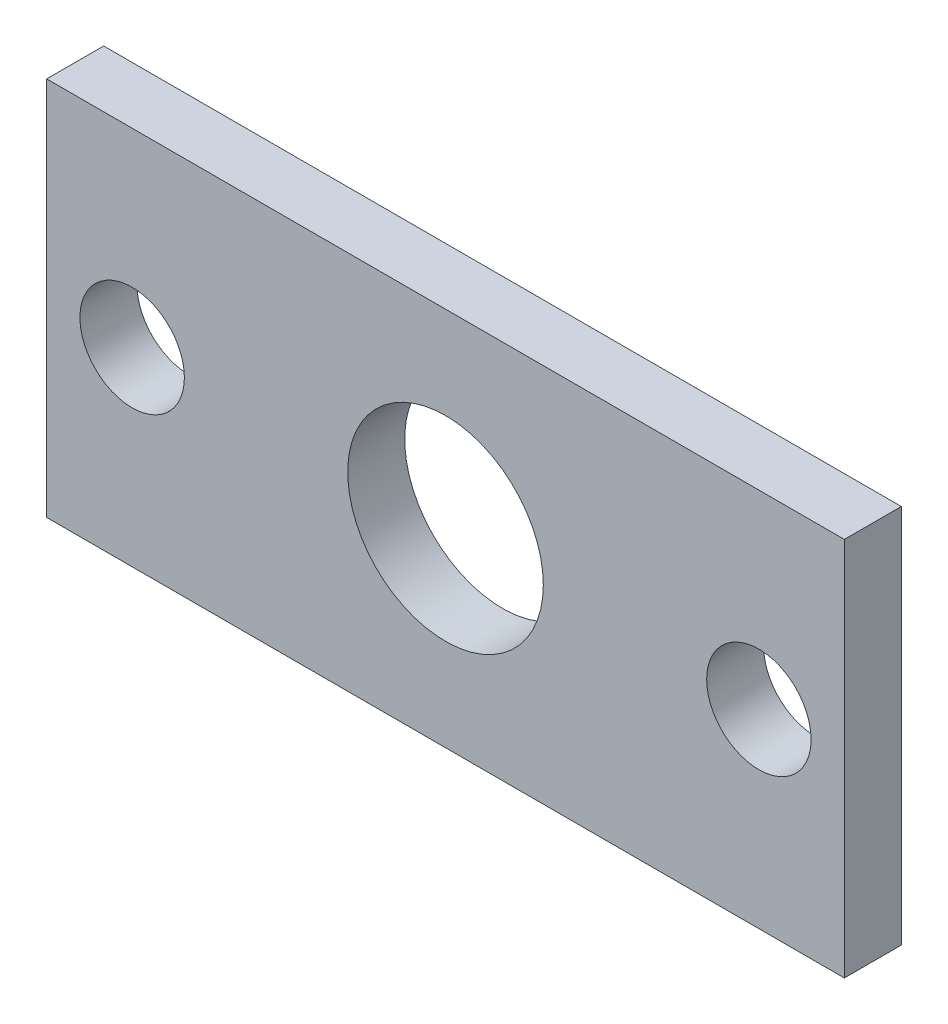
from build123d import *

# Parameters (mm, degrees)
SKETCH_1_W          = 42
SKETCH_1_H          = 20
EXTRUDE_1_DEPTH     = 3
SKETCH_2_R          = 2.75
SKETCH_2_R_2        = 5.15
CUT_EXTRUDE_1_DEPTH = 3


with BuildPart() as part:
    # Sketch 1 → Extrude 1 (new body)
    with BuildSketch(Plane.XY):
        with Locations((14.12451242, 2.558225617)):
            Rectangle(SKETCH_1_W, SKETCH_1_H)
    extrude(amount=EXTRUDE_1_DEPTH)

    # Sketch 2 → Cut-Extrude 1 (cut)
    with BuildSketch(Plane.XY.offset(3)):
        with Locations((-2.37548758, 2.558225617)):
            Circle(SKETCH_2_R)
        with Locations(Location((30.62451242, 2.558225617, 0), (0, 0, 180))):
            Circle(SKETCH_2_R)
        with Locations((14.12451242, 2.558225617)):
            Circle(SKETCH_2_R_2)
    extrude(amount=-CUT_EXTRUDE_1_DEPTH, mode=Mode.SUBTRACT)


solid = part.part
